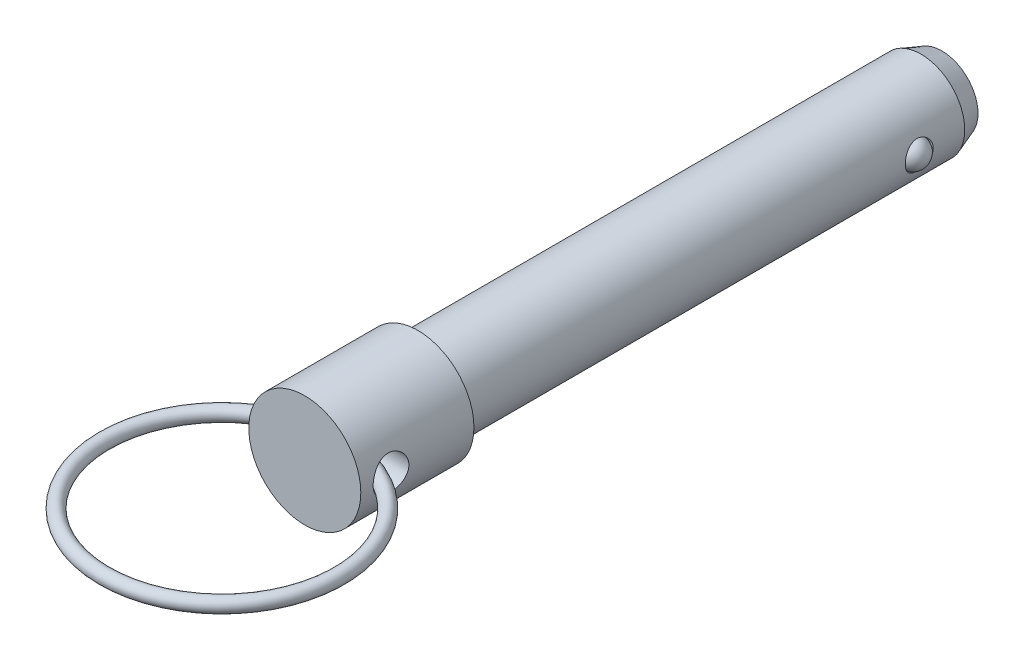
ISO-10303-21;
HEADER;
FILE_DESCRIPTION(('STEP AP214'),'2;1');
FILE_NAME('part.step','',(''),(''),'','','');
FILE_SCHEMA(('AUTOMOTIVE_DESIGN { 1 0 10303 214 1 1 1 1 }'));
ENDSEC;
DATA;
#1=APPLICATION_CONTEXT('core data for automotive mechanical design processes');
#2=APPLICATION_PROTOCOL_DEFINITION('international standard','automotive_design',2000,#1);
#3=PRODUCT_CONTEXT('',#1,'mechanical');
#4=PRODUCT('Part','Part','',(#3));
#5=PRODUCT_RELATED_PRODUCT_CATEGORY('part','',(#4));
#6=PRODUCT_DEFINITION_FORMATION('','',#4);
#7=PRODUCT_DEFINITION_CONTEXT('part definition',#1,'design');
#8=PRODUCT_DEFINITION('design','',#6,#7);
#9=PRODUCT_DEFINITION_SHAPE('','',#8);
#10=(LENGTH_UNIT() NAMED_UNIT(*) SI_UNIT(.MILLI.,.METRE.));
#11=(NAMED_UNIT(*) PLANE_ANGLE_UNIT() SI_UNIT($,.RADIAN.));
#12=(NAMED_UNIT(*) SI_UNIT($,.STERADIAN.) SOLID_ANGLE_UNIT());
#13=UNCERTAINTY_MEASURE_WITH_UNIT(LENGTH_MEASURE(1.E-05),#10,'distance_accuracy_value','');
#14=(GEOMETRIC_REPRESENTATION_CONTEXT(3) GLOBAL_UNCERTAINTY_ASSIGNED_CONTEXT((#13)) GLOBAL_UNIT_ASSIGNED_CONTEXT((#10,
#11,#12)) REPRESENTATION_CONTEXT('',''));
#15=CARTESIAN_POINT('',(0.,0.,0.));
#16=DIRECTION('',(0.,0.,1.));
#17=DIRECTION('',(1.,0.,0.));
#18=AXIS2_PLACEMENT_3D('',#15,#16,#17);
#19=CARTESIAN_POINT('',(7.9375,0.,9.398));
#20=DIRECTION('',(-1.,0.,0.));
#21=DIRECTION('',(0.,0.,-1.));
#22=AXIS2_PLACEMENT_3D('',#19,#20,#21);
#23=CYLINDRICAL_SURFACE('',#22,2.0193);
#24=CARTESIAN_POINT('',(-6.3502,0.292157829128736,11.3960531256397));
#25=CARTESIAN_POINT('',(-6.33446408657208,0.262361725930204,11.4004344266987));
#26=CARTESIAN_POINT('',(-6.32102794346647,0.231225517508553,11.4042829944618));
#27=CARTESIAN_POINT('',(-6.2992523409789,0.167152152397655,11.4106204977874));
#28=CARTESIAN_POINT('',(-6.29090461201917,0.134218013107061,11.413111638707));
#29=CARTESIAN_POINT('',(-6.27972917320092,0.0672091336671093,11.4164621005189));
#30=CARTESIAN_POINT('',(-6.27692077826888,0.0331308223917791,11.4173157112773));
#31=CARTESIAN_POINT('',(-6.27702601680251,-0.0350157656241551,11.4172838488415));
#32=CARTESIAN_POINT('',(-6.27993956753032,-0.0690840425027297,11.4163984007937));
#33=CARTESIAN_POINT('',(-6.29126629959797,-0.135748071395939,11.4130038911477));
#34=CARTESIAN_POINT('',(-6.29960976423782,-0.168356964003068,11.4105154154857));
#35=CARTESIAN_POINT('',(-6.32127848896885,-0.231802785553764,11.404211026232));
#36=CARTESIAN_POINT('',(-6.33461136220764,-0.26263692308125,11.4003930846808));
#37=CARTESIAN_POINT('',(-6.3502,-0.29215782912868,11.3960531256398));
#38=B_SPLINE_CURVE_WITH_KNOTS('',3,(#24,#25,#26,#27,#28,#29,#30,#31,#32,#33,#34,#35,#36,#37),
.UNSPECIFIED.,.F.,.F.,(4,2,2,2,2,2,4),(0.,0.10189986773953,0.203633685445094,0.305721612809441,
0.407808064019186,0.508608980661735,0.609564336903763),.UNSPECIFIED.);
#39=CARTESIAN_POINT('',(-6.34383491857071,0.279747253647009,11.3978284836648));
#40=VERTEX_POINT('',#39);
#41=CARTESIAN_POINT('',(-6.34383491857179,-0.279747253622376,11.3978284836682));
#42=VERTEX_POINT('',#41);
#43=EDGE_CURVE('E40',#40,#42,#38,.T.);
#44=ORIENTED_EDGE('',*,*,#43,.F.);
#45=CARTESIAN_POINT('',(-6.35,0.,11.4173));
#46=CARTESIAN_POINT('',(-6.34999578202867,-0.110312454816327,11.417293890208));
#47=CARTESIAN_POINT('',(-6.34709412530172,-0.220741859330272,11.4082188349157));
#48=CARTESIAN_POINT('',(-6.3357852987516,-0.438477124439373,11.3722159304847));
#49=CARTESIAN_POINT('',(-6.3273687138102,-0.545777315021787,11.3452575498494));
#50=CARTESIAN_POINT('',(-6.30595235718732,-0.75391448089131,11.2744960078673));
#51=CARTESIAN_POINT('',(-6.29296259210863,-0.854765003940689,11.2307296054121));
#52=CARTESIAN_POINT('',(-6.26374009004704,-1.04765917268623,11.1277235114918));
#53=CARTESIAN_POINT('',(-6.24750783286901,-1.13970411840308,11.0684861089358));
#54=CARTESIAN_POINT('',(-6.2129360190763,-1.31536123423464,10.9342184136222));
#55=CARTESIAN_POINT('',(-6.19454917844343,-1.39865352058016,10.8587818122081));
#56=CARTESIAN_POINT('',(-6.15801023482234,-1.5516474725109,10.6951184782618));
#57=CARTESIAN_POINT('',(-6.13985819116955,-1.62134576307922,10.606888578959));
#58=CARTESIAN_POINT('',(-6.1053372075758,-1.74691684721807,10.4173629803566));
#59=CARTESIAN_POINT('',(-6.08902613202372,-1.80238797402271,10.315789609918));
#60=CARTESIAN_POINT('',(-6.06074349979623,-1.89532725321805,10.104153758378));
#61=CARTESIAN_POINT('',(-6.04877073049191,-1.93280043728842,9.99409365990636));
#62=CARTESIAN_POINT('',(-6.03101341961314,-1.9875076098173,9.77220930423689));
#63=CARTESIAN_POINT('',(-6.0250482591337,-2.00533395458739,9.66054596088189));
#64=CARTESIAN_POINT('',(-6.01944581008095,-2.02209234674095,9.43566621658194));
#65=CARTESIAN_POINT('',(-6.01980677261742,-2.02102961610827,9.32245025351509));
#66=CARTESIAN_POINT('',(-6.02665663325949,-2.00050250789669,9.10261826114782));
#67=CARTESIAN_POINT('',(-6.03289303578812,-1.98179631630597,8.99592223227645));
#68=CARTESIAN_POINT('',(-6.05038018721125,-1.92774435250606,8.78726894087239));
#69=CARTESIAN_POINT('',(-6.06163151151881,-1.89239667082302,8.68531222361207));
#70=CARTESIAN_POINT('',(-6.08807105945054,-1.80553890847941,8.48724541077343));
#71=CARTESIAN_POINT('',(-6.1033159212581,-1.75379385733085,8.39124624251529));
#72=CARTESIAN_POINT('',(-6.13599834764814,-1.63577635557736,8.20905256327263));
#73=CARTESIAN_POINT('',(-6.15343637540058,-1.56950083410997,8.12286013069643));
#74=CARTESIAN_POINT('',(-6.18954615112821,-1.42061516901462,7.95845350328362));
#75=CARTESIAN_POINT('',(-6.20823733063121,-1.33738288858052,7.88080597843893));
#76=CARTESIAN_POINT('',(-6.2440320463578,-1.15881168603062,7.74040227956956));
#77=CARTESIAN_POINT('',(-6.26113489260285,-1.06346754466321,7.67765255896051));
#78=CARTESIAN_POINT('',(-6.29201953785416,-0.86223092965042,7.56842117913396));
#79=CARTESIAN_POINT('',(-6.30576997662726,-0.756251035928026,7.5220914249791));
#80=CARTESIAN_POINT('',(-6.32815272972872,-0.537579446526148,7.448167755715));
#81=CARTESIAN_POINT('',(-6.3367955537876,-0.424902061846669,7.4205353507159));
#82=CARTESIAN_POINT('',(-6.34491251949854,-0.25933398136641,7.39474486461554));
#83=CARTESIAN_POINT('',(-6.3468148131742,-0.207677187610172,7.38873516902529));
#84=CARTESIAN_POINT('',(-6.34935954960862,-0.104022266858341,7.38071129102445));
#85=CARTESIAN_POINT('',(-6.35000198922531,-0.0520241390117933,7.37869711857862));
#86=CARTESIAN_POINT('',(-6.34999578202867,0.110312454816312,7.37870610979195));
#87=CARTESIAN_POINT('',(-6.34709412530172,0.22074185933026,7.38778116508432));
#88=CARTESIAN_POINT('',(-6.33578529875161,0.438477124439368,7.4237840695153));
#89=CARTESIAN_POINT('',(-6.32736871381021,0.545777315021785,7.45074245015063));
#90=CARTESIAN_POINT('',(-6.30595235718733,0.753914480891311,7.52150399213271));
#91=CARTESIAN_POINT('',(-6.29296259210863,0.85476500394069,7.56527039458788));
#92=CARTESIAN_POINT('',(-6.26374009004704,1.04765917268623,7.66827648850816));
#93=CARTESIAN_POINT('',(-6.24750783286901,1.13970411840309,7.72751389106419));
#94=CARTESIAN_POINT('',(-6.2129360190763,1.31536123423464,7.86178158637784));
#95=CARTESIAN_POINT('',(-6.19454917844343,1.39865352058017,7.93721818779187));
#96=CARTESIAN_POINT('',(-6.15801023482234,1.55164747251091,8.10088152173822));
#97=CARTESIAN_POINT('',(-6.13985819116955,1.62134576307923,8.18911142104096));
#98=CARTESIAN_POINT('',(-6.1053372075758,1.74691684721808,8.37863701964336));
#99=CARTESIAN_POINT('',(-6.08902613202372,1.80238797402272,8.48021039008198));
#100=CARTESIAN_POINT('',(-6.06074349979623,1.89532725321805,8.69184624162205));
#101=CARTESIAN_POINT('',(-6.04877073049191,1.93280043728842,8.80190634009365));
#102=CARTESIAN_POINT('',(-6.03101341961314,1.9875076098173,9.02379069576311));
#103=CARTESIAN_POINT('',(-6.0250482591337,2.0053339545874,9.13545403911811));
#104=CARTESIAN_POINT('',(-6.01944581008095,2.02209234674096,9.36033378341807));
#105=CARTESIAN_POINT('',(-6.01980677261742,2.02102961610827,9.47354974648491));
#106=CARTESIAN_POINT('',(-6.02665663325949,2.00050250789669,9.69338173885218));
#107=CARTESIAN_POINT('',(-6.03289303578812,1.98179631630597,9.80007776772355));
#108=CARTESIAN_POINT('',(-6.05038018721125,1.92774435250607,10.0087310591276));
#109=CARTESIAN_POINT('',(-6.06163151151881,1.89239667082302,10.1106877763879));
#110=CARTESIAN_POINT('',(-6.08807105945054,1.80553890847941,10.3087545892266));
#111=CARTESIAN_POINT('',(-6.1033159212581,1.75379385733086,10.4047537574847));
#112=CARTESIAN_POINT('',(-6.13599834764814,1.63577635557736,10.5869474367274));
#113=CARTESIAN_POINT('',(-6.15343637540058,1.56950083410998,10.6731398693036));
#114=CARTESIAN_POINT('',(-6.18954615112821,1.42061516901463,10.8375464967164));
#115=CARTESIAN_POINT('',(-6.20823733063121,1.33738288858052,10.9151940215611));
#116=CARTESIAN_POINT('',(-6.2440320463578,1.15881168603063,11.0555977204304));
#117=CARTESIAN_POINT('',(-6.26113489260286,1.06346754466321,11.1183474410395));
#118=CARTESIAN_POINT('',(-6.29201953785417,0.862230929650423,11.227578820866));
#119=CARTESIAN_POINT('',(-6.30576997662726,0.756251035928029,11.2739085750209));
#120=CARTESIAN_POINT('',(-6.32815272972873,0.537579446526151,11.347832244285));
#121=CARTESIAN_POINT('',(-6.33679555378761,0.424902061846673,11.3754646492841));
#122=CARTESIAN_POINT('',(-6.34491251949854,0.259333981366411,11.4012551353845));
#123=CARTESIAN_POINT('',(-6.34681481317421,0.207677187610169,11.4072648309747));
#124=CARTESIAN_POINT('',(-6.34935954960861,0.104022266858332,11.4152887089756));
#125=CARTESIAN_POINT('',(-6.35000198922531,0.05202413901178,11.4173028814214));
#126=CARTESIAN_POINT('',(-6.35,0.,11.4173));
#127=B_SPLINE_CURVE_WITH_KNOTS('',3,(#45,#46,#47,#48,#49,#50,#51,#52,#53,#54,#55,#56,#57,#58,
#59,#60,#61,#62,#63,#64,#65,#66,#67,#68,#69,#70,#71,#72,#73,#74,#75,#76,#77,#78,#79,#80,#81,#82,
#83,#84,#85,#86,#87,#88,#89,#90,#91,#92,#93,#94,#95,#96,#97,#98,#99,#100,#101,#102,#103,#104,
#105,#106,#107,#108,#109,#110,#111,#112,#113,#114,#115,#116,#117,#118,#119,#120,#121,#122,#123,
#124,#125,#126),.UNSPECIFIED.,.T.,.F.,(4,2,2,2,2,2,2,2,2,2,2,2,2,2,2,2,2,2,2,2,2,2,2,2,2,2,2,2,
2,2,2,2,2,2,2,2,2,2,2,2,4),(0.,0.330736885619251,0.66203988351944,0.992622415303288,
1.32315606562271,1.66322530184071,2.00337886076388,2.35228054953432,2.70108463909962,
3.0390572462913,3.37693642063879,3.70092724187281,4.02495524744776,4.35385413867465,
4.68282260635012,5.02727904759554,5.37188442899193,5.71959937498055,6.06659632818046,
6.22257380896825,6.37855167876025,6.70928856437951,7.04059156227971,7.37117409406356,
7.70170774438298,8.04177698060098,8.38193053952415,8.73083222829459,9.0796363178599,
9.41760892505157,9.75548809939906,10.0794789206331,10.403506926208,10.7324058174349,
11.0613742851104,11.4058307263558,11.7504361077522,12.0981510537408,12.4451480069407,
12.6011254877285,12.7571033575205),.UNSPECIFIED.);
#128=EDGE_CURVE('E66',#42,#40,#127,.T.);
#129=ORIENTED_EDGE('',*,*,#128,.F.);
#130=EDGE_LOOP('',(#44,#129));
#131=FACE_BOUND('',#130,.T.);
#132=CARTESIAN_POINT('',(6.3502,-0.29215782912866,11.3960531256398));
#133=CARTESIAN_POINT('',(6.33446408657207,-0.26236172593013,11.4004344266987));
#134=CARTESIAN_POINT('',(6.32102794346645,-0.231225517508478,11.4042829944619));
#135=CARTESIAN_POINT('',(6.29925234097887,-0.167152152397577,11.4106204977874));
#136=CARTESIAN_POINT('',(6.29090461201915,-0.13421801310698,11.413111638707));
#137=CARTESIAN_POINT('',(6.27972917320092,-0.0672091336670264,11.4164621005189));
#138=CARTESIAN_POINT('',(6.27692077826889,-0.0331308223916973,11.4173157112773));
#139=CARTESIAN_POINT('',(6.27702601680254,0.0350157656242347,11.4172838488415));
#140=CARTESIAN_POINT('',(6.27993956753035,0.0690840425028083,11.4163984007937));
#141=CARTESIAN_POINT('',(6.29126629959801,0.135748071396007,11.4130038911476));
#142=CARTESIAN_POINT('',(6.29960976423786,0.168356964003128,11.4105154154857));
#143=CARTESIAN_POINT('',(6.32127848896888,0.231802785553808,11.404211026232));
#144=CARTESIAN_POINT('',(6.33461136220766,0.262636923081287,11.4003930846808));
#145=CARTESIAN_POINT('',(6.3502,0.292157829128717,11.3960531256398));
#146=B_SPLINE_CURVE_WITH_KNOTS('',3,(#132,#133,#134,#135,#136,#137,#138,#139,#140,#141,#142,
#143,#144,#145),.UNSPECIFIED.,.F.,.F.,(4,2,2,2,2,2,4),(0.,0.101899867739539,0.203633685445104,
0.305721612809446,0.40780806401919,0.508608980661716,0.609564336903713),.UNSPECIFIED.);
#147=CARTESIAN_POINT('',(6.3438349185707,-0.27974725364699,11.3978284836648));
#148=VERTEX_POINT('',#147);
#149=CARTESIAN_POINT('',(6.3438349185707,0.279747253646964,11.3978284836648));
#150=VERTEX_POINT('',#149);
#151=EDGE_CURVE('E33',#148,#150,#146,.T.);
#152=ORIENTED_EDGE('',*,*,#151,.F.);
#153=CARTESIAN_POINT('',(6.35,0.,7.3787));
#154=CARTESIAN_POINT('',(6.34999578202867,-0.110312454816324,7.37870610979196));
#155=CARTESIAN_POINT('',(6.34709412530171,-0.220741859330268,7.38778116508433));
#156=CARTESIAN_POINT('',(6.3357852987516,-0.438477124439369,7.4237840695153));
#157=CARTESIAN_POINT('',(6.32736871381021,-0.545777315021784,7.45074245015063));
#158=CARTESIAN_POINT('',(6.30595235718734,-0.753914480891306,7.52150399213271));
#159=CARTESIAN_POINT('',(6.29296259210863,-0.854765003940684,7.56527039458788));
#160=CARTESIAN_POINT('',(6.26374009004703,-1.04765917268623,7.66827648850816));
#161=CARTESIAN_POINT('',(6.247507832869,-1.13970411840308,7.72751389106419));
#162=CARTESIAN_POINT('',(6.2129360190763,-1.31536123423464,7.86178158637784));
#163=CARTESIAN_POINT('',(6.19454917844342,-1.39865352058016,7.93721818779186));
#164=CARTESIAN_POINT('',(6.15801023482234,-1.5516474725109,8.10088152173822));
#165=CARTESIAN_POINT('',(6.13985819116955,-1.62134576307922,8.18911142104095));
#166=CARTESIAN_POINT('',(6.1053372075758,-1.74691684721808,8.37863701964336));
#167=CARTESIAN_POINT('',(6.08902613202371,-1.80238797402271,8.48021039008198));
#168=CARTESIAN_POINT('',(6.06074349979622,-1.89532725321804,8.69184624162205));
#169=CARTESIAN_POINT('',(6.04877073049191,-1.93280043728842,8.80190634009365));
#170=CARTESIAN_POINT('',(6.03101341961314,-1.9875076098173,9.02379069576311));
#171=CARTESIAN_POINT('',(6.02504825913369,-2.00533395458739,9.13545403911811));
#172=CARTESIAN_POINT('',(6.01944581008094,-2.02209234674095,9.36033378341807));
#173=CARTESIAN_POINT('',(6.01980677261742,-2.02102961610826,9.47354974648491));
#174=CARTESIAN_POINT('',(6.02665663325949,-2.00050250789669,9.69338173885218));
#175=CARTESIAN_POINT('',(6.03289303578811,-1.98179631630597,9.80007776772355));
#176=CARTESIAN_POINT('',(6.05038018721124,-1.92774435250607,10.0087310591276));
#177=CARTESIAN_POINT('',(6.06163151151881,-1.89239667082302,10.1106877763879));
#178=CARTESIAN_POINT('',(6.08807105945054,-1.80553890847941,10.3087545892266));
#179=CARTESIAN_POINT('',(6.1033159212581,-1.75379385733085,10.4047537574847));
#180=CARTESIAN_POINT('',(6.13599834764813,-1.63577635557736,10.5869474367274));
#181=CARTESIAN_POINT('',(6.15343637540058,-1.56950083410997,10.6731398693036));
#182=CARTESIAN_POINT('',(6.18954615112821,-1.42061516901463,10.8375464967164));
#183=CARTESIAN_POINT('',(6.2082373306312,-1.33738288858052,10.9151940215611));
#184=CARTESIAN_POINT('',(6.24403204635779,-1.15881168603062,11.0555977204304));
#185=CARTESIAN_POINT('',(6.26113489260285,-1.0634675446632,11.1183474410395));
#186=CARTESIAN_POINT('',(6.29201953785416,-0.862230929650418,11.227578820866));
#187=CARTESIAN_POINT('',(6.30576997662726,-0.756251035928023,11.2739085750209));
#188=CARTESIAN_POINT('',(6.32815272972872,-0.537579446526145,11.347832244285));
#189=CARTESIAN_POINT('',(6.3367955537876,-0.424902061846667,11.3754646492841));
#190=CARTESIAN_POINT('',(6.34491251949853,-0.259333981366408,11.4012551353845));
#191=CARTESIAN_POINT('',(6.3468148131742,-0.20767718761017,11.4072648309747));
#192=CARTESIAN_POINT('',(6.34935954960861,-0.104022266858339,11.4152887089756));
#193=CARTESIAN_POINT('',(6.35000198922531,-0.0520241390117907,11.4173028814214));
#194=CARTESIAN_POINT('',(6.34999578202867,0.110312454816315,11.417293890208));
#195=CARTESIAN_POINT('',(6.34709412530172,0.220741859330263,11.4082188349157));
#196=CARTESIAN_POINT('',(6.33578529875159,0.43847712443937,11.3722159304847));
#197=CARTESIAN_POINT('',(6.3273687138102,0.545777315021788,11.3452575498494));
#198=CARTESIAN_POINT('',(6.30595235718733,0.753914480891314,11.2744960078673));
#199=CARTESIAN_POINT('',(6.29296259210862,0.854765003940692,11.2307296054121));
#200=CARTESIAN_POINT('',(6.26374009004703,1.04765917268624,11.1277235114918));
#201=CARTESIAN_POINT('',(6.247507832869,1.13970411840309,11.0684861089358));
#202=CARTESIAN_POINT('',(6.21293601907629,1.31536123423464,10.9342184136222));
#203=CARTESIAN_POINT('',(6.19454917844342,1.39865352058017,10.8587818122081));
#204=CARTESIAN_POINT('',(6.15801023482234,1.55164747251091,10.6951184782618));
#205=CARTESIAN_POINT('',(6.13985819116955,1.62134576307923,10.606888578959));
#206=CARTESIAN_POINT('',(6.1053372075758,1.74691684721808,10.4173629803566));
#207=CARTESIAN_POINT('',(6.08902613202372,1.80238797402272,10.315789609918));
#208=CARTESIAN_POINT('',(6.06074349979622,1.89532725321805,10.104153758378));
#209=CARTESIAN_POINT('',(6.0487707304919,1.93280043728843,9.99409365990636));
#210=CARTESIAN_POINT('',(6.03101341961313,1.9875076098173,9.77220930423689));
#211=CARTESIAN_POINT('',(6.02504825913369,2.0053339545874,9.66054596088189));
#212=CARTESIAN_POINT('',(6.01944581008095,2.02209234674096,9.43566621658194));
#213=CARTESIAN_POINT('',(6.01980677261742,2.02102961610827,9.32245025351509));
#214=CARTESIAN_POINT('',(6.02665663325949,2.00050250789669,9.10261826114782));
#215=CARTESIAN_POINT('',(6.03289303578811,1.98179631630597,8.99592223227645));
#216=CARTESIAN_POINT('',(6.05038018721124,1.92774435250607,8.78726894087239));
#217=CARTESIAN_POINT('',(6.06163151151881,1.89239667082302,8.68531222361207));
#218=CARTESIAN_POINT('',(6.08807105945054,1.80553890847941,8.48724541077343));
#219=CARTESIAN_POINT('',(6.1033159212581,1.75379385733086,8.39124624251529));
#220=CARTESIAN_POINT('',(6.13599834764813,1.63577635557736,8.20905256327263));
#221=CARTESIAN_POINT('',(6.15343637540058,1.56950083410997,8.12286013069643));
#222=CARTESIAN_POINT('',(6.18954615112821,1.42061516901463,7.95845350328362));
#223=CARTESIAN_POINT('',(6.2082373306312,1.33738288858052,7.88080597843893));
#224=CARTESIAN_POINT('',(6.24403204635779,1.15881168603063,7.74040227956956));
#225=CARTESIAN_POINT('',(6.26113489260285,1.06346754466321,7.67765255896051));
#226=CARTESIAN_POINT('',(6.29201953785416,0.862230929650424,7.56842117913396));
#227=CARTESIAN_POINT('',(6.30576997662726,0.75625103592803,7.5220914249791));
#228=CARTESIAN_POINT('',(6.32815272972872,0.537579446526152,7.448167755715));
#229=CARTESIAN_POINT('',(6.3367955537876,0.424902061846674,7.4205353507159));
#230=CARTESIAN_POINT('',(6.34491251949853,0.259333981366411,7.39474486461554));
#231=CARTESIAN_POINT('',(6.3468148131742,0.20767718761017,7.38873516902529));
#232=CARTESIAN_POINT('',(6.34935954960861,0.104022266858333,7.38071129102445));
#233=CARTESIAN_POINT('',(6.35000198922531,0.0520241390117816,7.37869711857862));
#234=CARTESIAN_POINT('',(6.35,0.,7.3787));
#235=B_SPLINE_CURVE_WITH_KNOTS('',3,(#153,#154,#155,#156,#157,#158,#159,#160,#161,#162,#163,
#164,#165,#166,#167,#168,#169,#170,#171,#172,#173,#174,#175,#176,#177,#178,#179,#180,#181,#182,
#183,#184,#185,#186,#187,#188,#189,#190,#191,#192,#193,#194,#195,#196,#197,#198,#199,#200,#201,
#202,#203,#204,#205,#206,#207,#208,#209,#210,#211,#212,#213,#214,#215,#216,#217,#218,#219,#220,
#221,#222,#223,#224,#225,#226,#227,#228,#229,#230,#231,#232,#233,#234),.UNSPECIFIED.,.T.,.F.,(4,
2,2,2,2,2,2,2,2,2,2,2,2,2,2,2,2,2,2,2,2,2,2,2,2,2,2,2,2,2,2,2,2,2,2,2,2,2,2,2,4),(0.,
0.330736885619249,0.662039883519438,0.992622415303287,1.3231560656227,1.66322530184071,
2.00337886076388,2.35228054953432,2.70108463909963,3.0390572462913,3.37693642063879,
3.7009272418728,4.02495524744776,4.35385413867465,4.68282260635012,5.02727904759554,
5.37188442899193,5.71959937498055,6.06659632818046,6.22257380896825,6.37855167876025,
6.70928856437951,7.04059156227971,7.37117409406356,7.70170774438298,8.04177698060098,
8.38193053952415,8.73083222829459,9.07963631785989,9.41760892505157,9.75548809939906,
10.0794789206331,10.403506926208,10.7324058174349,11.0613742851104,11.4058307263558,
11.7504361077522,12.0981510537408,12.4451480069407,12.6011254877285,12.7571033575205),.UNSPECIFIED.);
#236=EDGE_CURVE('E62',#150,#148,#235,.T.);
#237=ORIENTED_EDGE('',*,*,#236,.F.);
#238=EDGE_LOOP('',(#152,#237));
#239=FACE_BOUND('',#238,.T.);
#240=ADVANCED_FACE('F14',(#131,#239),#23,.F.);
#241=CARTESIAN_POINT('',(0.,0.,-34.39922));
#242=DIRECTION('',(0.,0.,-1.));
#243=DIRECTION('',(1.,0.,0.));
#244=AXIS2_PLACEMENT_3D('',#241,#242,#243);
#245=CYLINDRICAL_SURFACE('',#244,6.35);
#246=ORIENTED_EDGE('',*,*,#236,.T.);
#247=CARTESIAN_POINT('',(6.34665582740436,-0.206057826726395,9.6663673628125));
#248=CARTESIAN_POINT('',(6.3452849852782,-0.248279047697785,9.67828523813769));
#249=CARTESIAN_POINT('',(6.34352249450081,-0.289459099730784,9.69386090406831));
#250=CARTESIAN_POINT('',(6.33942011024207,-0.368543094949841,9.73178017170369));
#251=CARTESIAN_POINT('',(6.33708008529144,-0.406446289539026,9.75412531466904));
#252=CARTESIAN_POINT('',(6.33209241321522,-0.477899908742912,9.8047666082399));
#253=CARTESIAN_POINT('',(6.32944535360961,-0.511458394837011,9.83305147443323));
#254=CARTESIAN_POINT('',(6.32412241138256,-0.573540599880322,9.89467297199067));
#255=CARTESIAN_POINT('',(6.32144652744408,-0.60206408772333,9.92800983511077));
#256=CARTESIAN_POINT('',(6.31623478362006,-0.654523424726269,10.0000464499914));
#257=CARTESIAN_POINT('',(6.31370785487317,-0.678248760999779,10.0388997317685));
#258=CARTESIAN_POINT('',(6.30914807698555,-0.719430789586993,10.1198151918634));
#259=CARTESIAN_POINT('',(6.30711537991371,-0.736885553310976,10.1618783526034));
#260=CARTESIAN_POINT('',(6.30356963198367,-0.766652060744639,10.2517585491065));
#261=CARTESIAN_POINT('',(6.30211474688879,-0.778407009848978,10.2997618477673));
#262=CARTESIAN_POINT('',(6.30009638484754,-0.794575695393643,10.3969997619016));
#263=CARTESIAN_POINT('',(6.2995332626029,-0.798986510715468,10.4462348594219));
#264=CARTESIAN_POINT('',(6.29930439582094,-0.800791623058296,10.5499764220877));
#265=CARTESIAN_POINT('',(6.29973840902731,-0.797405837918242,10.6044969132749));
#266=CARTESIAN_POINT('',(6.30162771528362,-0.782332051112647,10.7123814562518));
#267=CARTESIAN_POINT('',(6.30308376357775,-0.770637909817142,10.7657446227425));
#268=CARTESIAN_POINT('',(6.30699495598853,-0.737976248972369,10.8743575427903));
#269=CARTESIAN_POINT('',(6.309522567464,-0.716323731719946,10.9294001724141));
#270=CARTESIAN_POINT('',(6.31524450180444,-0.663986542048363,11.0349896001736));
#271=CARTESIAN_POINT('',(6.3184385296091,-0.633305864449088,11.0855383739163));
#272=CARTESIAN_POINT('',(6.32446092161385,-0.569663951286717,11.1714846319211));
#273=CARTESIAN_POINT('',(6.3272488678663,-0.538153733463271,11.2079604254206));
#274=CARTESIAN_POINT('',(6.33270636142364,-0.46958313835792,11.2752665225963));
#275=CARTESIAN_POINT('',(6.3353760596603,-0.4325301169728,11.3061041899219));
#276=CARTESIAN_POINT('',(6.33987873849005,-0.359908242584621,11.3561064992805));
#277=CARTESIAN_POINT('',(6.34177713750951,-0.325092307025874,11.3763560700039));
#278=CARTESIAN_POINT('',(6.3450791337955,-0.252556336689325,11.4108259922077));
#279=CARTESIAN_POINT('',(6.34648300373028,-0.214837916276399,11.4250496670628));
#280=CARTESIAN_POINT('',(6.34863622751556,-0.137224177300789,11.446638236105));
#281=CARTESIAN_POINT('',(6.34938200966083,-0.0973182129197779,11.4539657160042));
#282=CARTESIAN_POINT('',(6.35010496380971,-0.0168334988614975,11.4610716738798));
#283=CARTESIAN_POINT('',(6.35008242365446,0.0237449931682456,11.4608529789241));
#284=CARTESIAN_POINT('',(6.34931136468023,0.100393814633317,11.4532686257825));
#285=CARTESIAN_POINT('',(6.34863038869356,0.136533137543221,11.4465678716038));
#286=CARTESIAN_POINT('',(6.3467164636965,0.207223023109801,11.4274006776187));
#287=CARTESIAN_POINT('',(6.34548344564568,0.241773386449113,11.4149335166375));
#288=CARTESIAN_POINT('',(6.3425416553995,0.30960697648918,11.3844132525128));
#289=CARTESIAN_POINT('',(6.34081891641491,0.342814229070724,11.3661941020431));
#290=CARTESIAN_POINT('',(6.3370736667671,0.406211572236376,11.3251453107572));
#291=CARTESIAN_POINT('',(6.33505103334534,0.436400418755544,11.3023137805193));
#292=CARTESIAN_POINT('',(6.33055131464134,0.49769573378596,11.2491439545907));
#293=CARTESIAN_POINT('',(6.32805141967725,0.52826875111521,11.2181940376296));
#294=CARTESIAN_POINT('',(6.32308163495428,0.58475974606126,11.1523092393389));
#295=CARTESIAN_POINT('',(6.32061176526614,0.610674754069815,11.1173718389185));
#296=CARTESIAN_POINT('',(6.31545647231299,0.662038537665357,11.0376631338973));
#297=CARTESIAN_POINT('',(6.31281513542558,0.686522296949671,10.9922657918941));
#298=CARTESIAN_POINT('',(6.30810097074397,0.728566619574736,10.8983369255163));
#299=CARTESIAN_POINT('',(6.30602851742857,0.746122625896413,10.8498033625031));
#300=CARTESIAN_POINT('',(6.30243933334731,0.775896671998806,10.7442183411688));
#301=CARTESIAN_POINT('',(6.30103001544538,0.787122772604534,10.6868803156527));
#302=CARTESIAN_POINT('',(6.29940721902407,0.800007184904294,10.5710986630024));
#303=CARTESIAN_POINT('',(6.29919407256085,0.80166283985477,10.5126547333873));
#304=CARTESIAN_POINT('',(6.30005021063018,0.794909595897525,10.3956729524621));
#305=CARTESIAN_POINT('',(6.30113381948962,0.786388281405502,10.33714131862));
#306=CARTESIAN_POINT('',(6.30452399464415,0.758730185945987,10.2226628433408));
#307=CARTESIAN_POINT('',(6.30682981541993,0.739599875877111,10.1667144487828));
#308=CARTESIAN_POINT('',(6.31212037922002,0.692916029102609,10.0644672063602));
#309=CARTESIAN_POINT('',(6.31502617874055,0.666266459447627,10.0177527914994));
#310=CARTESIAN_POINT('',(6.32122790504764,0.604592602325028,9.93024699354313));
#311=CARTESIAN_POINT('',(6.32452352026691,0.569574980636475,9.88945093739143));
#312=CARTESIAN_POINT('',(6.33066231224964,0.49639434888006,9.81967919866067));
#313=CARTESIAN_POINT('',(6.3335154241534,0.458999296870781,9.78989736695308));
#314=CARTESIAN_POINT('',(6.33878167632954,0.379383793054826,9.73763453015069));
#315=CARTESIAN_POINT('',(6.34119502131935,0.337165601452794,9.71515012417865));
#316=CARTESIAN_POINT('',(6.34510608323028,0.252558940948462,9.67976956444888));
#317=CARTESIAN_POINT('',(6.3466587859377,0.210419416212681,9.66628201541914));
#318=CARTESIAN_POINT('',(6.34892624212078,0.124425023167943,9.64681261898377));
#319=CARTESIAN_POINT('',(6.34964132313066,0.0805708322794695,9.64082783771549));
#320=CARTESIAN_POINT('',(6.35013003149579,-0.00429887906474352,9.63672685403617));
#321=CARTESIAN_POINT('',(6.3499683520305,-0.0452888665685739,9.63806999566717));
#322=CARTESIAN_POINT('',(6.34886964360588,-0.126506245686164,9.64734016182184));
#323=CARTESIAN_POINT('',(6.3479326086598,-0.166733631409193,9.65526723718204));
#324=CARTESIAN_POINT('',(6.34665582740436,-0.206057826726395,9.6663673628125));
#325=B_SPLINE_CURVE_WITH_KNOTS('',3,(#247,#248,#249,#250,#251,#252,#253,#254,#255,#256,#257,
#258,#259,#260,#261,#262,#263,#264,#265,#266,#267,#268,#269,#270,#271,#272,#273,#274,#275,#276,
#277,#278,#279,#280,#281,#282,#283,#284,#285,#286,#287,#288,#289,#290,#291,#292,#293,#294,#295,
#296,#297,#298,#299,#300,#301,#302,#303,#304,#305,#306,#307,#308,#309,#310,#311,#312,#313,#314,
#315,#316,#317,#318,#319,#320,#321,#322,#323,#324),.UNSPECIFIED.,.T.,.F.,(4,2,2,2,2,2,2,2,2,2,2,
2,2,2,2,2,2,2,2,2,2,2,2,2,2,2,2,2,2,2,2,2,2,2,2,2,2,2,4),(0.,0.131523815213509,
0.263077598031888,0.394383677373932,0.52569578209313,0.661900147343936,0.798146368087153,
0.94586459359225,1.09364155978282,1.25683680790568,1.42015277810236,1.59693202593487,
1.77363316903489,1.91791685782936,2.06201073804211,2.18247669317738,2.30287612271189,
2.4239250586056,2.54492864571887,2.65470676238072,2.76449861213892,2.87780525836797,
2.99115841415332,3.12140054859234,3.25172542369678,3.40605418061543,3.56048428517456,
3.73501068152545,3.90958552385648,4.08610670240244,4.26252033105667,4.42319186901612,
4.58373584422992,4.72664586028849,4.86948917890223,5.00164792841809,5.13375498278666,
5.25625329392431,5.37875255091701),.UNSPECIFIED.);
#326=EDGE_CURVE('E27',#148,#150,#325,.T.);
#327=ORIENTED_EDGE('',*,*,#326,.T.);
#328=EDGE_LOOP('',(#246,#327));
#329=FACE_BOUND('',#328,.T.);
#330=CARTESIAN_POINT('',(0.,0.,12.8270000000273));
#331=DIRECTION('',(0.,0.,-1.));
#332=DIRECTION('',(1.,0.,0.));
#333=AXIS2_PLACEMENT_3D('',#330,#331,#332);
#334=CIRCLE('',#333,6.34999999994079);
#335=CARTESIAN_POINT('',(6.34999999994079,0.,12.8270000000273));
#336=VERTEX_POINT('',#335);
#337=EDGE_CURVE('E71',#336,#336,#334,.T.);
#338=ORIENTED_EDGE('',*,*,#337,.T.);
#339=EDGE_LOOP('',(#338));
#340=FACE_BOUND('',#339,.T.);
#341=CARTESIAN_POINT('',(0.,0.,1.16087695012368E-11));
#342=DIRECTION('',(0.,0.,-1.));
#343=DIRECTION('',(1.,0.,0.));
#344=AXIS2_PLACEMENT_3D('',#341,#342,#343);
#345=CIRCLE('',#344,6.34999999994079);
#346=CARTESIAN_POINT('',(6.34999999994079,0.,1.16084896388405E-11));
#347=VERTEX_POINT('',#346);
#348=EDGE_CURVE('E279',#347,#347,#345,.T.);
#349=ORIENTED_EDGE('',*,*,#348,.F.);
#350=EDGE_LOOP('',(#349));
#351=FACE_BOUND('',#350,.T.);
#352=ORIENTED_EDGE('',*,*,#128,.T.);
#353=CARTESIAN_POINT('',(-6.34665582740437,-0.206057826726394,9.66636736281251));
#354=CARTESIAN_POINT('',(-6.34797934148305,-0.165285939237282,9.65485950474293));
#355=CARTESIAN_POINT('',(-6.34893816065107,-0.123532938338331,9.64675937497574));
#356=CARTESIAN_POINT('',(-6.35001869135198,-0.0392395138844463,9.63764831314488));
#357=CARTESIAN_POINT('',(-6.35014017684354,0.00330111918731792,9.63663929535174));
#358=CARTESIAN_POINT('',(-6.34953206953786,0.0879394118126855,9.64174776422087));
#359=CARTESIAN_POINT('',(-6.34880260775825,0.13003713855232,9.6478641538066));
#360=CARTESIAN_POINT('',(-6.34657447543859,0.212600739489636,9.66701677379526));
#361=CARTESIAN_POINT('',(-6.34507584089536,0.253066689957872,9.68005268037));
#362=CARTESIAN_POINT('',(-6.34146900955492,0.33138158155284,9.7126623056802));
#363=CARTESIAN_POINT('',(-6.33935898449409,0.36922224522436,9.73225566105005));
#364=CARTESIAN_POINT('',(-6.33475813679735,0.441182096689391,9.77733154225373));
#365=CARTESIAN_POINT('',(-6.33226728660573,0.475301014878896,9.80281449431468));
#366=CARTESIAN_POINT('',(-6.32708436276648,0.539990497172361,9.85971055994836));
#367=CARTESIAN_POINT('',(-6.32438850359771,0.570424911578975,9.89127784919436));
#368=CARTESIAN_POINT('',(-6.31913817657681,0.625916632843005,9.95882994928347));
#369=CARTESIAN_POINT('',(-6.31658374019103,0.650972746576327,9.9948157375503));
#370=CARTESIAN_POINT('',(-6.31170869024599,0.69670392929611,10.0724886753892));
#371=CARTESIAN_POINT('',(-6.30941195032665,0.71701708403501,10.1143899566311));
#372=CARTESIAN_POINT('',(-6.30545539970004,0.751016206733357,10.2008200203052));
#373=CARTESIAN_POINT('',(-6.30379582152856,0.764699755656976,10.245349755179));
#374=CARTESIAN_POINT('',(-6.30112261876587,0.786439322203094,10.3401349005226));
#375=CARTESIAN_POINT('',(-6.30018307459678,0.793856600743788,10.3905385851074));
#376=CARTESIAN_POINT('',(-6.29927265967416,0.80104628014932,10.4918905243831));
#377=CARTESIAN_POINT('',(-6.29930218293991,0.80081557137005,10.5428389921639));
#378=CARTESIAN_POINT('',(-6.3003424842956,0.792594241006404,10.6494235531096));
#379=CARTESIAN_POINT('',(-6.30145478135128,0.783800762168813,10.7049973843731));
#380=CARTESIAN_POINT('',(-6.30465473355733,0.757628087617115,10.8140964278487));
#381=CARTESIAN_POINT('',(-6.30674324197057,0.740241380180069,10.8676198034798));
#382=CARTESIAN_POINT('',(-6.3117978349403,0.695872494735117,10.9743734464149));
#383=CARTESIAN_POINT('',(-6.31480965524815,0.668369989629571,11.0273869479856));
#384=CARTESIAN_POINT('',(-6.32125797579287,0.604341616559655,11.127620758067));
#385=CARTESIAN_POINT('',(-6.32469393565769,0.567827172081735,11.1748482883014));
#386=CARTESIAN_POINT('',(-6.33064540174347,0.496358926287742,11.2504526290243));
#387=CARTESIAN_POINT('',(-6.33317742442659,0.46327295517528,11.2805972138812));
#388=CARTESIAN_POINT('',(-6.33795112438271,0.392589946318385,11.3350975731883));
#389=CARTESIAN_POINT('',(-6.34019298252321,0.354995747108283,11.3594569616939));
#390=CARTESIAN_POINT('',(-6.34414022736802,0.275631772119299,11.4012144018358));
#391=CARTESIAN_POINT('',(-6.34584084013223,0.233828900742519,11.418550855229));
#392=CARTESIAN_POINT('',(-6.3484301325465,0.147595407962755,11.4446164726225));
#393=CARTESIAN_POINT('',(-6.34931975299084,0.103167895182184,11.4533556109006));
#394=CARTESIAN_POINT('',(-6.35008514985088,0.0199378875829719,11.4608753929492));
#395=CARTESIAN_POINT('',(-6.35008843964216,-0.0187536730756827,11.4609085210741));
#396=CARTESIAN_POINT('',(-6.34939746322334,-0.0955170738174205,11.4541183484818));
#397=CARTESIAN_POINT('',(-6.34870331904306,-0.133589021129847,11.4472962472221));
#398=CARTESIAN_POINT('',(-6.34675486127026,-0.206035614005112,11.4277870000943));
#399=CARTESIAN_POINT('',(-6.34553149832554,-0.240499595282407,11.4154227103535));
#400=CARTESIAN_POINT('',(-6.34265636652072,-0.307121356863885,11.3856122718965));
#401=CARTESIAN_POINT('',(-6.34100449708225,-0.339278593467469,11.3681649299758));
#402=CARTESIAN_POINT('',(-6.33723692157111,-0.403825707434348,11.3269948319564));
#403=CARTESIAN_POINT('',(-6.33509154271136,-0.435925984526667,11.3028229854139));
#404=CARTESIAN_POINT('',(-6.33064272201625,-0.496369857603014,11.250192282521));
#405=CARTESIAN_POINT('',(-6.32833919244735,-0.524711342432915,11.2217310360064));
#406=CARTESIAN_POINT('',(-6.32334030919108,-0.582098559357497,11.1560085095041));
#407=CARTESIAN_POINT('',(-6.3206477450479,-0.610381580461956,11.118081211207));
#408=CARTESIAN_POINT('',(-6.31552631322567,-0.661272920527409,11.0385798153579));
#409=CARTESIAN_POINT('',(-6.31309762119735,-0.683877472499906,10.9970033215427));
#410=CARTESIAN_POINT('',(-6.30833642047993,-0.72658870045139,10.9038901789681));
#411=CARTESIAN_POINT('',(-6.30608942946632,-0.745628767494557,10.851857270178));
#412=CARTESIAN_POINT('',(-6.30248979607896,-0.775466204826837,10.7454330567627));
#413=CARTESIAN_POINT('',(-6.30113765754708,-0.786258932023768,10.69104044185));
#414=CARTESIAN_POINT('',(-6.29944352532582,-0.799728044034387,10.5770263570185));
#415=CARTESIAN_POINT('',(-6.29918591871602,-0.80172680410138,10.5173211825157));
#416=CARTESIAN_POINT('',(-6.30000525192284,-0.795264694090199,10.3984664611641));
#417=CARTESIAN_POINT('',(-6.30108195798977,-0.786805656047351,10.3393168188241));
#418=CARTESIAN_POINT('',(-6.30440515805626,-0.759704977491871,10.2262823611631));
#419=CARTESIAN_POINT('',(-6.30659553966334,-0.741549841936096,10.1722805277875));
#420=CARTESIAN_POINT('',(-6.31185428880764,-0.695364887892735,10.0687073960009));
#421=CARTESIAN_POINT('',(-6.31492202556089,-0.667342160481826,10.0191329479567));
#422=CARTESIAN_POINT('',(-6.32113146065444,-0.605515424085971,9.93168975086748));
#423=CARTESIAN_POINT('',(-6.32422841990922,-0.572678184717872,9.89313380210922));
#424=CARTESIAN_POINT('',(-6.33035789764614,-0.500375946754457,9.82285661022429));
#425=CARTESIAN_POINT('',(-6.33339048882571,-0.46091892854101,9.79112724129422));
#426=CARTESIAN_POINT('',(-6.33833786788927,-0.386069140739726,9.74204682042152));
#427=CARTESIAN_POINT('',(-6.34035098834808,-0.351739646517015,9.723067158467));
#428=CARTESIAN_POINT('',(-6.34389840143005,-0.280571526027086,9.69054512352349));
#429=CARTESIAN_POINT('',(-6.3454328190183,-0.243733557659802,9.67700133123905));
#430=CARTESIAN_POINT('',(-6.34665582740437,-0.206057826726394,9.66636736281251));
#431=B_SPLINE_CURVE_WITH_KNOTS('',3,(#353,#354,#355,#356,#357,#358,#359,#360,#361,#362,#363,
#364,#365,#366,#367,#368,#369,#370,#371,#372,#373,#374,#375,#376,#377,#378,#379,#380,#381,#382,
#383,#384,#385,#386,#387,#388,#389,#390,#391,#392,#393,#394,#395,#396,#397,#398,#399,#400,#401,
#402,#403,#404,#405,#406,#407,#408,#409,#410,#411,#412,#413,#414,#415,#416,#417,#418,#419,#420,
#421,#422,#423,#424,#425,#426,#427,#428,#429,#430),.UNSPECIFIED.,.T.,.F.,(4,2,2,2,2,2,2,2,2,2,2,
2,2,2,2,2,2,2,2,2,2,2,2,2,2,2,2,2,2,2,2,2,2,2,2,2,2,2,4),(0.,0.127017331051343,0.25406894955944,
0.381101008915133,0.50812712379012,0.63553708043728,0.762956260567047,0.894175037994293,
1.0254228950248,1.16470220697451,1.30403230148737,1.45626942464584,1.60856844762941,
1.7766734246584,1.94492561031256,2.12343441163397,2.30171808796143,2.43568966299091,
2.56957732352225,2.70461513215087,2.83949608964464,2.95496006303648,3.07040383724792,
3.17985460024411,3.28933107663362,3.40960027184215,3.52993673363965,3.67156568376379,
3.81328834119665,3.97894617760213,4.14469720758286,4.32301887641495,4.50130931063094,
4.67139503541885,4.84135878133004,4.99274402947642,5.14394807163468,5.26135056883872,
5.37872239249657),.UNSPECIFIED.);
#432=EDGE_CURVE('E9',#40,#42,#431,.T.);
#433=ORIENTED_EDGE('',*,*,#432,.T.);
#434=EDGE_LOOP('',(#352,#433));
#435=FACE_BOUND('',#434,.T.);
#436=ADVANCED_FACE('F64',(#329,#340,#351,#435),#245,.T.);
#437=CARTESIAN_POINT('',(0.,0.,-25.));
#438=DIRECTION('',(0.,0.,1.));
#439=DIRECTION('',(-0.810321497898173,-0.585985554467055,0.));
#440=AXIS2_PLACEMENT_3D('',#437,#438,#439);
#441=CYLINDRICAL_SURFACE('',#440,4.95554);
#442=CARTESIAN_POINT('',(0.,0.,0.));
#443=DIRECTION('',(0.,0.,-1.));
#444=DIRECTION('',(0.810321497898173,0.585985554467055,0.));
#445=AXIS2_PLACEMENT_3D('',#442,#443,#444);
#446=CIRCLE('',#445,4.95554);
#447=CARTESIAN_POINT('',(4.01558059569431,2.90387485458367,0.));
#448=VERTEX_POINT('',#447);
#449=EDGE_CURVE('E60',#448,#448,#446,.T.);
#450=ORIENTED_EDGE('',*,*,#449,.T.);
#451=EDGE_LOOP('',(#450));
#452=FACE_BOUND('',#451,.T.);
#453=CARTESIAN_POINT('',(4.95554,0.,-50.29332));
#454=CARTESIAN_POINT('',(4.95553666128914,0.0866897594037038,-50.2933248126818));
#455=CARTESIAN_POINT('',(4.95324045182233,0.173471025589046,-50.3004537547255));
#456=CARTESIAN_POINT('',(4.9442912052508,0.344577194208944,-50.3287349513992));
#457=CARTESIAN_POINT('',(4.9376307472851,0.428897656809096,-50.3499110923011));
#458=CARTESIAN_POINT('',(4.92068254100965,0.592457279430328,-50.4054922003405));
#459=CARTESIAN_POINT('',(4.9104027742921,0.67170717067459,-50.4398680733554));
#460=CARTESIAN_POINT('',(4.88727518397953,0.823288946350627,-50.5207700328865));
#461=CARTESIAN_POINT('',(4.87442773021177,0.895621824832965,-50.5672943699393));
#462=CARTESIAN_POINT('',(4.84705629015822,1.0336940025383,-50.6727644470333));
#463=CARTESIAN_POINT('',(4.83249427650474,1.09917878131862,-50.7320335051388));
#464=CARTESIAN_POINT('',(4.80355063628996,1.21947281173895,-50.8606252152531));
#465=CARTESIAN_POINT('',(4.78916905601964,1.27427937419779,-50.9299503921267));
#466=CARTESIAN_POINT('',(4.76180578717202,1.37305673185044,-51.0789084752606));
#467=CARTESIAN_POINT('',(4.74887057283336,1.41670648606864,-51.1587636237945));
#468=CARTESIAN_POINT('',(4.72643603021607,1.48985016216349,-51.3251622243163));
#469=CARTESIAN_POINT('',(4.71693572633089,1.51934810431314,-51.4117037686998));
#470=CARTESIAN_POINT('',(4.70284355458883,1.56241523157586,-51.5861508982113));
#471=CARTESIAN_POINT('',(4.69810668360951,1.57645629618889,-51.6739279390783));
#472=CARTESIAN_POINT('',(4.69364777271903,1.58968567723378,-51.8507099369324));
#473=CARTESIAN_POINT('',(4.69392432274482,1.58887816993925,-51.9397145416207));
#474=CARTESIAN_POINT('',(4.6993333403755,1.57280144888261,-52.1124771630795));
#475=CARTESIAN_POINT('',(4.70426240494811,1.55813797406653,-52.1962990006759));
#476=CARTESIAN_POINT('',(4.71808978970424,1.51574977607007,-52.3602240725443));
#477=CARTESIAN_POINT('',(4.72698857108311,1.48802353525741,-52.4403268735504));
#478=CARTESIAN_POINT('',(4.74790477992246,1.41987997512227,-52.5959596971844));
#479=CARTESIAN_POINT('',(4.75996755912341,1.3792761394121,-52.6714016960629));
#480=CARTESIAN_POINT('',(4.78583160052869,1.28666181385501,-52.8145932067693));
#481=CARTESIAN_POINT('',(4.79963323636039,1.23464887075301,-52.8823410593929));
#482=CARTESIAN_POINT('',(4.82822844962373,1.11775274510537,-53.0116328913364));
#483=CARTESIAN_POINT('',(4.84303789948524,1.05237301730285,-53.0727252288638));
#484=CARTESIAN_POINT('',(4.87140539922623,0.912085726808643,-53.1832136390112));
#485=CARTESIAN_POINT('',(4.88496290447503,0.837174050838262,-53.2326046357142));
#486=CARTESIAN_POINT('',(4.90945634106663,0.679024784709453,-53.3186171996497));
#487=CARTESIAN_POINT('',(4.92036685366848,0.595716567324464,-53.3551163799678));
#488=CARTESIAN_POINT('',(4.93813643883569,0.423802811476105,-53.4133833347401));
#489=CARTESIAN_POINT('',(4.94500382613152,0.335208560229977,-53.435181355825));
#490=CARTESIAN_POINT('',(4.95147275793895,0.204839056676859,-53.4555865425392));
#491=CARTESIAN_POINT('',(4.95299354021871,0.164038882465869,-53.4603558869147));
#492=CARTESIAN_POINT('',(4.95502795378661,0.082165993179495,-53.4667237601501));
#493=CARTESIAN_POINT('',(4.95554158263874,0.0410932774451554,-53.4683222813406));
#494=CARTESIAN_POINT('',(4.95553666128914,-0.0866897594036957,-53.4683151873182));
#495=CARTESIAN_POINT('',(4.95324045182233,-0.17347102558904,-53.4611862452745));
#496=CARTESIAN_POINT('',(4.9442912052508,-0.344577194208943,-53.4329050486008));
#497=CARTESIAN_POINT('',(4.9376307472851,-0.4288976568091,-53.4117289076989));
#498=CARTESIAN_POINT('',(4.92068254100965,-0.592457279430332,-53.3561477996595));
#499=CARTESIAN_POINT('',(4.9104027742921,-0.67170717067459,-53.3217719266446));
#500=CARTESIAN_POINT('',(4.88727518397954,-0.823288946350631,-53.2408699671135));
#501=CARTESIAN_POINT('',(4.87442773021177,-0.895621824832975,-53.1943456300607));
#502=CARTESIAN_POINT('',(4.84705629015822,-1.03369400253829,-53.0888755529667));
#503=CARTESIAN_POINT('',(4.83249427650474,-1.0991787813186,-53.0296064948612));
#504=CARTESIAN_POINT('',(4.80355063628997,-1.21947281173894,-52.901014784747));
#505=CARTESIAN_POINT('',(4.78916905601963,-1.27427937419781,-52.8316896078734));
#506=CARTESIAN_POINT('',(4.76180578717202,-1.37305673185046,-52.6827315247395));
#507=CARTESIAN_POINT('',(4.74887057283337,-1.41670648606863,-52.6028763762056));
#508=CARTESIAN_POINT('',(4.72643603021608,-1.48985016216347,-52.4364777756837));
#509=CARTESIAN_POINT('',(4.71693572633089,-1.51934810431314,-52.3499362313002));
#510=CARTESIAN_POINT('',(4.70284355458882,-1.56241523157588,-52.1754891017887));
#511=CARTESIAN_POINT('',(4.69810668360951,-1.5764562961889,-52.0877120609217));
#512=CARTESIAN_POINT('',(4.69364777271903,-1.58968567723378,-51.9109300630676));
#513=CARTESIAN_POINT('',(4.69392432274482,-1.58887816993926,-51.8219254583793));
#514=CARTESIAN_POINT('',(4.6993333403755,-1.57280144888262,-51.6491628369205));
#515=CARTESIAN_POINT('',(4.70426240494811,-1.55813797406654,-51.5653409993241));
#516=CARTESIAN_POINT('',(4.71808978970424,-1.51574977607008,-51.4014159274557));
#517=CARTESIAN_POINT('',(4.72698857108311,-1.48802353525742,-51.3213131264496));
#518=CARTESIAN_POINT('',(4.74790477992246,-1.41987997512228,-51.1656803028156));
#519=CARTESIAN_POINT('',(4.7599675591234,-1.37927613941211,-51.0902383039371));
#520=CARTESIAN_POINT('',(4.78583160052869,-1.28666181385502,-50.9470467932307));
#521=CARTESIAN_POINT('',(4.79963323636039,-1.23464887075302,-50.8792989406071));
#522=CARTESIAN_POINT('',(4.82822844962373,-1.11775274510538,-50.7500071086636));
#523=CARTESIAN_POINT('',(4.84303789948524,-1.05237301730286,-50.6889147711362));
#524=CARTESIAN_POINT('',(4.87140539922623,-0.912085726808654,-50.5784263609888));
#525=CARTESIAN_POINT('',(4.88496290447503,-0.83717405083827,-50.5290353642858));
#526=CARTESIAN_POINT('',(4.90945634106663,-0.679024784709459,-50.4430228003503));
#527=CARTESIAN_POINT('',(4.92036685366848,-0.59571656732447,-50.4065236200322));
#528=CARTESIAN_POINT('',(4.93813643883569,-0.423802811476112,-50.3482566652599));
#529=CARTESIAN_POINT('',(4.94500382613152,-0.335208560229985,-50.326458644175));
#530=CARTESIAN_POINT('',(4.95147275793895,-0.204839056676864,-50.3060534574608));
#531=CARTESIAN_POINT('',(4.95299354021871,-0.164038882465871,-50.3012841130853));
#532=CARTESIAN_POINT('',(4.95502795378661,-0.0821659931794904,-50.2949162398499));
#533=CARTESIAN_POINT('',(4.95554158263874,-0.041093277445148,-50.2933177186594));
#534=CARTESIAN_POINT('',(4.95554,0.,-50.29332));
#535=B_SPLINE_CURVE_WITH_KNOTS('',3,(#453,#454,#455,#456,#457,#458,#459,#460,#461,#462,#463,
#464,#465,#466,#467,#468,#469,#470,#471,#472,#473,#474,#475,#476,#477,#478,#479,#480,#481,#482,
#483,#484,#485,#486,#487,#488,#489,#490,#491,#492,#493,#494,#495,#496,#497,#498,#499,#500,#501,
#502,#503,#504,#505,#506,#507,#508,#509,#510,#511,#512,#513,#514,#515,#516,#517,#518,#519,#520,
#521,#522,#523,#524,#525,#526,#527,#528,#529,#530,#531,#532,#533,#534),.UNSPECIFIED.,.T.,.F.,(4,
2,2,2,2,2,2,2,2,2,2,2,2,2,2,2,2,2,2,2,2,2,2,2,2,2,2,2,2,2,2,2,2,2,2,2,2,2,2,2,4),(0.,
0.259910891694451,0.520264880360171,0.780048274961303,1.03979427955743,1.30713240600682,
1.57453777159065,1.84893984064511,2.12326391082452,2.38895860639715,2.6545785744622,
2.9090987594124,3.16364852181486,3.42206782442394,3.6805427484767,3.9513789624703,
4.2223324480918,4.49579311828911,4.76868943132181,4.89189388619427,5.01509863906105,
5.27500953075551,5.53536351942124,5.79514691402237,6.0548929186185,6.32223104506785,
6.58963641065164,6.86403847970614,7.13836254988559,7.40405724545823,7.66967721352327,
7.92419739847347,8.17874716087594,8.43716646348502,8.69564138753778,8.96647760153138,
9.23743108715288,9.51089175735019,9.78378807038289,9.90699252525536,10.0301972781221),.UNSPECIFIED.);
#536=CARTESIAN_POINT('',(4.95554,0.,-50.29332));
#537=VERTEX_POINT('',#536);
#538=EDGE_CURVE('E132',#537,#537,#535,.T.);
#539=ORIENTED_EDGE('',*,*,#538,.T.);
#540=EDGE_LOOP('',(#539));
#541=FACE_BOUND('',#540,.T.);
#542=CARTESIAN_POINT('',(0.,0.,-57.03702));
#543=DIRECTION('',(0.,0.,-1.));
#544=DIRECTION('',(-1.,0.,0.));
#545=AXIS2_PLACEMENT_3D('',#542,#543,#544);
#546=CIRCLE('',#545,4.95554);
#547=CARTESIAN_POINT('',(-4.95553999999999,0.,-57.03702));
#548=VERTEX_POINT('',#547);
#549=EDGE_CURVE('E117',#548,#548,#546,.F.);
#550=ORIENTED_EDGE('',*,*,#549,.T.);
#551=EDGE_LOOP('',(#550));
#552=FACE_BOUND('',#551,.T.);
#553=CARTESIAN_POINT('',(-4.95554,0.,-53.46832));
#554=CARTESIAN_POINT('',(-4.95553666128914,0.0866897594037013,-53.4683151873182));
#555=CARTESIAN_POINT('',(-4.95324045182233,0.173471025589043,-53.4611862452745));
#556=CARTESIAN_POINT('',(-4.94429120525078,0.34457719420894,-53.4329050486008));
#557=CARTESIAN_POINT('',(-4.93763074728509,0.428897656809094,-53.4117289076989));
#558=CARTESIAN_POINT('',(-4.92068254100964,0.592457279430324,-53.3561477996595));
#559=CARTESIAN_POINT('',(-4.91040277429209,0.671707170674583,-53.3217719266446));
#560=CARTESIAN_POINT('',(-4.88727518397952,0.823288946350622,-53.2408699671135));
#561=CARTESIAN_POINT('',(-4.87442773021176,0.895621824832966,-53.1943456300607));
#562=CARTESIAN_POINT('',(-4.84705629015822,1.03369400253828,-53.0888755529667));
#563=CARTESIAN_POINT('',(-4.83249427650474,1.09917878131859,-53.0296064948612));
#564=CARTESIAN_POINT('',(-4.80355063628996,1.21947281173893,-52.901014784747));
#565=CARTESIAN_POINT('',(-4.78916905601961,1.27427937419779,-52.8316896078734));
#566=CARTESIAN_POINT('',(-4.761805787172,1.37305673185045,-52.6827315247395));
#567=CARTESIAN_POINT('',(-4.74887057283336,1.41670648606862,-52.6028763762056));
#568=CARTESIAN_POINT('',(-4.72643603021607,1.48985016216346,-52.4364777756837));
#569=CARTESIAN_POINT('',(-4.71693572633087,1.51934810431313,-52.3499362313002));
#570=CARTESIAN_POINT('',(-4.7028435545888,1.56241523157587,-52.1754891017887));
#571=CARTESIAN_POINT('',(-4.6981066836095,1.57645629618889,-52.0877120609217));
#572=CARTESIAN_POINT('',(-4.69364777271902,1.58968567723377,-51.9109300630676));
#573=CARTESIAN_POINT('',(-4.69392432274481,1.58887816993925,-51.8219254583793));
#574=CARTESIAN_POINT('',(-4.69933334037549,1.57280144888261,-51.6491628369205));
#575=CARTESIAN_POINT('',(-4.7042624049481,1.55813797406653,-51.5653409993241));
#576=CARTESIAN_POINT('',(-4.71808978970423,1.51574977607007,-51.4014159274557));
#577=CARTESIAN_POINT('',(-4.72698857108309,1.48802353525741,-51.3213131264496));
#578=CARTESIAN_POINT('',(-4.74790477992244,1.41987997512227,-51.1656803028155));
#579=CARTESIAN_POINT('',(-4.7599675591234,1.37927613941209,-51.0902383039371));
#580=CARTESIAN_POINT('',(-4.78583160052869,1.28666181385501,-50.9470467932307));
#581=CARTESIAN_POINT('',(-4.79963323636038,1.23464887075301,-50.8792989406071));
#582=CARTESIAN_POINT('',(-4.82822844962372,1.11775274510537,-50.7500071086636));
#583=CARTESIAN_POINT('',(-4.84303789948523,1.05237301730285,-50.6889147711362));
#584=CARTESIAN_POINT('',(-4.87140539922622,0.912085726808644,-50.5784263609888));
#585=CARTESIAN_POINT('',(-4.88496290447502,0.837174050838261,-50.5290353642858));
#586=CARTESIAN_POINT('',(-4.90945634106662,0.67902478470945,-50.4430228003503));
#587=CARTESIAN_POINT('',(-4.92036685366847,0.595716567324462,-50.4065236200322));
#588=CARTESIAN_POINT('',(-4.93813643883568,0.423802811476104,-50.3482566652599));
#589=CARTESIAN_POINT('',(-4.94500382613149,0.335208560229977,-50.326458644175));
#590=CARTESIAN_POINT('',(-4.95147275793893,0.204839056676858,-50.3060534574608));
#591=CARTESIAN_POINT('',(-4.9529935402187,0.164038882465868,-50.3012841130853));
#592=CARTESIAN_POINT('',(-4.9550279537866,0.0821659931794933,-50.2949162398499));
#593=CARTESIAN_POINT('',(-4.95554158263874,0.0410932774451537,-50.2933177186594));
#594=CARTESIAN_POINT('',(-4.95553666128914,-0.0866897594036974,-50.2933248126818));
#595=CARTESIAN_POINT('',(-4.95324045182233,-0.173471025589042,-50.3004537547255));
#596=CARTESIAN_POINT('',(-4.94429120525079,-0.344577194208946,-50.3287349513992));
#597=CARTESIAN_POINT('',(-4.93763074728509,-0.428897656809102,-50.3499110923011));
#598=CARTESIAN_POINT('',(-4.92068254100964,-0.592457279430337,-50.4054922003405));
#599=CARTESIAN_POINT('',(-4.91040277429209,-0.671707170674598,-50.4398680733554));
#600=CARTESIAN_POINT('',(-4.88727518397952,-0.823288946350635,-50.5207700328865));
#601=CARTESIAN_POINT('',(-4.87442773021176,-0.895621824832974,-50.5672943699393));
#602=CARTESIAN_POINT('',(-4.84705629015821,-1.0336940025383,-50.6727644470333));
#603=CARTESIAN_POINT('',(-4.83249427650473,-1.09917878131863,-50.7320335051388));
#604=CARTESIAN_POINT('',(-4.80355063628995,-1.21947281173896,-50.8606252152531));
#605=CARTESIAN_POINT('',(-4.78916905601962,-1.2742793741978,-50.9299503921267));
#606=CARTESIAN_POINT('',(-4.761805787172,-1.37305673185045,-51.0789084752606));
#607=CARTESIAN_POINT('',(-4.74887057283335,-1.41670648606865,-51.1587636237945));
#608=CARTESIAN_POINT('',(-4.72643603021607,-1.48985016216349,-51.3251622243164));
#609=CARTESIAN_POINT('',(-4.71693572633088,-1.51934810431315,-51.4117037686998));
#610=CARTESIAN_POINT('',(-4.70284355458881,-1.56241523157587,-51.5861508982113));
#611=CARTESIAN_POINT('',(-4.6981066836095,-1.5764562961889,-51.6739279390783));
#612=CARTESIAN_POINT('',(-4.69364777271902,-1.58968567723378,-51.8507099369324));
#613=CARTESIAN_POINT('',(-4.69392432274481,-1.58887816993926,-51.9397145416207));
#614=CARTESIAN_POINT('',(-4.69933334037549,-1.57280144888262,-52.1124771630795));
#615=CARTESIAN_POINT('',(-4.7042624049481,-1.55813797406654,-52.1962990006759));
#616=CARTESIAN_POINT('',(-4.71808978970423,-1.51574977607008,-52.3602240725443));
#617=CARTESIAN_POINT('',(-4.72698857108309,-1.48802353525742,-52.4403268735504));
#618=CARTESIAN_POINT('',(-4.74790477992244,-1.41987997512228,-52.5959596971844));
#619=CARTESIAN_POINT('',(-4.75996755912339,-1.37927613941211,-52.6714016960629));
#620=CARTESIAN_POINT('',(-4.78583160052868,-1.28666181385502,-52.8145932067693));
#621=CARTESIAN_POINT('',(-4.79963323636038,-1.23464887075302,-52.8823410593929));
#622=CARTESIAN_POINT('',(-4.82822844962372,-1.11775274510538,-53.0116328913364));
#623=CARTESIAN_POINT('',(-4.84303789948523,-1.05237301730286,-53.0727252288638));
#624=CARTESIAN_POINT('',(-4.87140539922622,-0.912085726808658,-53.1832136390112));
#625=CARTESIAN_POINT('',(-4.88496290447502,-0.837174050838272,-53.2326046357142));
#626=CARTESIAN_POINT('',(-4.90945634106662,-0.679024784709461,-53.3186171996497));
#627=CARTESIAN_POINT('',(-4.92036685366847,-0.595716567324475,-53.3551163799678));
#628=CARTESIAN_POINT('',(-4.93813643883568,-0.423802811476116,-53.4133833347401));
#629=CARTESIAN_POINT('',(-4.94500382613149,-0.335208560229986,-53.435181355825));
#630=CARTESIAN_POINT('',(-4.95147275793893,-0.204839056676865,-53.4555865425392));
#631=CARTESIAN_POINT('',(-4.9529935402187,-0.164038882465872,-53.4603558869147));
#632=CARTESIAN_POINT('',(-4.9550279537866,-0.0821659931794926,-53.4667237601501));
#633=CARTESIAN_POINT('',(-4.95554158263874,-0.0410932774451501,-53.4683222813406));
#634=CARTESIAN_POINT('',(-4.95554,0.,-53.46832));
#635=B_SPLINE_CURVE_WITH_KNOTS('',3,(#553,#554,#555,#556,#557,#558,#559,#560,#561,#562,#563,
#564,#565,#566,#567,#568,#569,#570,#571,#572,#573,#574,#575,#576,#577,#578,#579,#580,#581,#582,
#583,#584,#585,#586,#587,#588,#589,#590,#591,#592,#593,#594,#595,#596,#597,#598,#599,#600,#601,
#602,#603,#604,#605,#606,#607,#608,#609,#610,#611,#612,#613,#614,#615,#616,#617,#618,#619,#620,
#621,#622,#623,#624,#625,#626,#627,#628,#629,#630,#631,#632,#633,#634),.UNSPECIFIED.,.T.,.F.,(4,
2,2,2,2,2,2,2,2,2,2,2,2,2,2,2,2,2,2,2,2,2,2,2,2,2,2,2,2,2,2,2,2,2,2,2,2,2,2,2,4),(0.,
0.259910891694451,0.520264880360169,0.780048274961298,1.03979427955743,1.30713240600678,
1.57453777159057,1.84893984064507,2.12326391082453,2.38895860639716,2.65457857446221,
2.90909875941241,3.16364852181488,3.42206782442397,3.68054274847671,3.95137896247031,
4.22233244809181,4.49579311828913,4.76868943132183,4.89189388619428,5.01509863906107,
5.27500953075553,5.53536351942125,5.79514691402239,6.05489291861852,6.3222310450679,
6.58963641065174,6.8640384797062,7.1383625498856,7.40405724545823,7.66967721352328,
7.92419739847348,8.17874716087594,8.43716646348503,8.69564138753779,8.96647760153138,
9.23743108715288,9.5108917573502,9.7837880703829,9.90699252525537,10.0301972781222),.UNSPECIFIED.);
#636=CARTESIAN_POINT('',(-4.95554,0.,-53.46832));
#637=VERTEX_POINT('',#636);
#638=EDGE_CURVE('E141',#637,#637,#635,.T.);
#639=ORIENTED_EDGE('',*,*,#638,.T.);
#640=EDGE_LOOP('',(#639));
#641=FACE_BOUND('',#640,.T.);
#642=ADVANCED_FACE('F16',(#452,#541,#552,#641),#441,.T.);
#643=CARTESIAN_POINT('',(0.,-6.096,12.827));
#644=DIRECTION('',(0.,0.,1.));
#645=DIRECTION('',(-1.,0.,0.));
#646=AXIS2_PLACEMENT_3D('',#643,#644,#645);
#647=PLANE('',#646);
#648=ORIENTED_EDGE('',*,*,#337,.F.);
#649=EDGE_LOOP('',(#648));
#650=FACE_BOUND('',#649,.T.);
#651=ADVANCED_FACE('F150',(#650),#647,.T.);
#652=CARTESIAN_POINT('',(0.,-4.95554,0.));
#653=DIRECTION('',(0.,0.,-1.));
#654=DIRECTION('',(1.,0.,0.));
#655=AXIS2_PLACEMENT_3D('',#652,#653,#654);
#656=PLANE('',#655);
#657=ORIENTED_EDGE('',*,*,#348,.T.);
#658=EDGE_LOOP('',(#657));
#659=FACE_BOUND('',#658,.T.);
#660=ORIENTED_EDGE('',*,*,#449,.F.);
#661=EDGE_LOOP('',(#660));
#662=FACE_BOUND('',#661,.T.);
#663=ADVANCED_FACE('F86',(#659,#662),#656,.T.);
#664=CARTESIAN_POINT('',(-4.2037,0.,-51.88082));
#665=DIRECTION('',(0.,0.,-1.));
#666=DIRECTION('',(1.,0.,0.));
#667=AXIS2_PLACEMENT_3D('',#664,#665,#666);
#668=SPHERICAL_SURFACE('',#667,1.5875);
#669=CARTESIAN_POINT('',(-4.2037,0.,-51.88082));
#670=DIRECTION('',(1.,0.,0.));
#671=DIRECTION('',(0.,0.,-1.));
#672=AXIS2_PLACEMENT_3D('',#669,#670,#671);
#673=CIRCLE('',#672,1.5875);
#674=CARTESIAN_POINT('',(-4.2037,0.,-53.46832));
#675=VERTEX_POINT('',#674);
#676=CARTESIAN_POINT('',(-4.2037,0.,-50.29332));
#677=VERTEX_POINT('',#676);
#678=EDGE_CURVE('E112',#675,#677,#673,.F.);
#679=ORIENTED_EDGE('',*,*,#678,.T.);
#680=CARTESIAN_POINT('',(-4.2037,0.,-51.88082));
#681=DIRECTION('',(1.,0.,0.));
#682=DIRECTION('',(0.,0.,-1.));
#683=AXIS2_PLACEMENT_3D('',#680,#681,#682);
#684=CIRCLE('',#683,1.5875);
#685=EDGE_CURVE('E140',#677,#675,#684,.F.);
#686=ORIENTED_EDGE('',*,*,#685,.T.);
#687=EDGE_LOOP('',(#679,#686));
#688=FACE_BOUND('',#687,.T.);
#689=ADVANCED_FACE('F120',(#688),#668,.T.);
#690=CARTESIAN_POINT('',(0.,0.,-59.39922));
#691=DIRECTION('',(0.,0.,-1.));
#692=DIRECTION('',(-1.,0.,0.));
#693=AXIS2_PLACEMENT_3D('',#690,#691,#692);
#694=PLANE('',#693);
#695=CARTESIAN_POINT('',(0.,0.,-59.3992200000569));
#696=DIRECTION('',(0.,0.,1.));
#697=DIRECTION('',(1.,0.,0.));
#698=AXIS2_PLACEMENT_3D('',#695,#696,#697);
#699=CIRCLE('',#698,4.0957695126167);
#700=CARTESIAN_POINT('',(4.09576951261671,0.,-59.3992200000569));
#701=VERTEX_POINT('',#700);
#702=EDGE_CURVE('E146',#701,#701,#699,.T.);
#703=ORIENTED_EDGE('',*,*,#702,.F.);
#704=EDGE_LOOP('',(#703));
#705=FACE_BOUND('',#704,.T.);
#706=ADVANCED_FACE('F123',(#705),#694,.T.);
#707=CARTESIAN_POINT('',(4.2037,0.,-51.88082));
#708=DIRECTION('',(0.,0.,1.));
#709=DIRECTION('',(1.,0.,0.));
#710=AXIS2_PLACEMENT_3D('',#707,#708,#709);
#711=SPHERICAL_SURFACE('',#710,1.5875);
#712=CARTESIAN_POINT('',(4.2037,0.,-51.88082));
#713=DIRECTION('',(1.,0.,0.));
#714=DIRECTION('',(0.,0.,-1.));
#715=AXIS2_PLACEMENT_3D('',#712,#713,#714);
#716=CIRCLE('',#715,1.5875);
#717=CARTESIAN_POINT('',(4.2037,0.,-53.46832));
#718=VERTEX_POINT('',#717);
#719=CARTESIAN_POINT('',(4.2037,0.,-50.29332));
#720=VERTEX_POINT('',#719);
#721=EDGE_CURVE('E255',#718,#720,#716,.T.);
#722=ORIENTED_EDGE('',*,*,#721,.T.);
#723=CARTESIAN_POINT('',(4.2037,0.,-51.88082));
#724=DIRECTION('',(1.,0.,0.));
#725=DIRECTION('',(0.,0.,-1.));
#726=AXIS2_PLACEMENT_3D('',#723,#724,#725);
#727=CIRCLE('',#726,1.5875);
#728=EDGE_CURVE('E257',#720,#718,#727,.T.);
#729=ORIENTED_EDGE('',*,*,#728,.T.);
#730=EDGE_LOOP('',(#722,#729));
#731=FACE_BOUND('',#730,.T.);
#732=ADVANCED_FACE('F97',(#731),#711,.T.);
#733=CARTESIAN_POINT('',(-6.35,0.,-51.88082));
#734=DIRECTION('',(1.,0.,0.));
#735=DIRECTION('',(0.,0.,-1.));
#736=AXIS2_PLACEMENT_3D('',#733,#734,#735);
#737=CYLINDRICAL_SURFACE('',#736,1.5875);
#738=ORIENTED_EDGE('',*,*,#638,.F.);
#739=EDGE_LOOP('',(#738));
#740=FACE_BOUND('',#739,.T.);
#741=ORIENTED_EDGE('',*,*,#678,.F.);
#742=ORIENTED_EDGE('',*,*,#685,.F.);
#743=EDGE_LOOP('',(#741,#742));
#744=FACE_BOUND('',#743,.T.);
#745=ADVANCED_FACE('F148',(#740,#744),#737,.F.);
#746=CARTESIAN_POINT('',(0.,0.,-57.0370200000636));
#747=DIRECTION('',(0.,0.,1.));
#748=DIRECTION('',(1.,0.,0.));
#749=AXIS2_PLACEMENT_3D('',#746,#747,#748);
#750=CONICAL_SURFACE('',#749,4.95553999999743,0.349065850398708);
#751=ORIENTED_EDGE('',*,*,#549,.F.);
#752=EDGE_LOOP('',(#751));
#753=FACE_BOUND('',#752,.T.);
#754=ORIENTED_EDGE('',*,*,#702,.T.);
#755=EDGE_LOOP('',(#754));
#756=FACE_BOUND('',#755,.T.);
#757=ADVANCED_FACE('F128',(#753,#756),#750,.T.);
#758=CARTESIAN_POINT('',(-6.35,0.,-51.88082));
#759=DIRECTION('',(1.,0.,0.));
#760=DIRECTION('',(0.,0.,-1.));
#761=AXIS2_PLACEMENT_3D('',#758,#759,#760);
#762=CYLINDRICAL_SURFACE('',#761,1.5875);
#763=ORIENTED_EDGE('',*,*,#721,.F.);
#764=ORIENTED_EDGE('',*,*,#728,.F.);
#765=EDGE_LOOP('',(#763,#764));
#766=FACE_BOUND('',#765,.T.);
#767=ORIENTED_EDGE('',*,*,#538,.F.);
#768=EDGE_LOOP('',(#767));
#769=FACE_BOUND('',#768,.T.);
#770=ADVANCED_FACE('F96',(#766,#769),#762,.F.);
#771=CARTESIAN_POINT('',(0.,0.,22.2270000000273));
#772=DIRECTION('',(0.,1.,0.));
#773=DIRECTION('',(0.,0.,1.));
#774=AXIS2_PLACEMENT_3D('',#771,#772,#773);
#775=TOROIDAL_SURFACE('',#774,13.3,0.8);
#776=ORIENTED_EDGE('',*,*,#326,.F.);
#777=ORIENTED_EDGE('',*,*,#151,.T.);
#778=EDGE_LOOP('',(#776,#777));
#779=FACE_BOUND('',#778,.T.);
#780=ORIENTED_EDGE('',*,*,#432,.F.);
#781=ORIENTED_EDGE('',*,*,#43,.T.);
#782=EDGE_LOOP('',(#780,#781));
#783=FACE_BOUND('',#782,.T.);
#784=ADVANCED_FACE('F56',(#779,#783),#775,.T.);
#785=CLOSED_SHELL('',(#240,#436,#642,#651,#663,#689,#706,#732,#745,#757,#770,#784));
#786=MANIFOLD_SOLID_BREP('B1',#785);
#787=ADVANCED_BREP_SHAPE_REPRESENTATION('',(#18,#786),#14);
#788=SHAPE_DEFINITION_REPRESENTATION(#9,#787);
ENDSEC;
END-ISO-10303-21;
